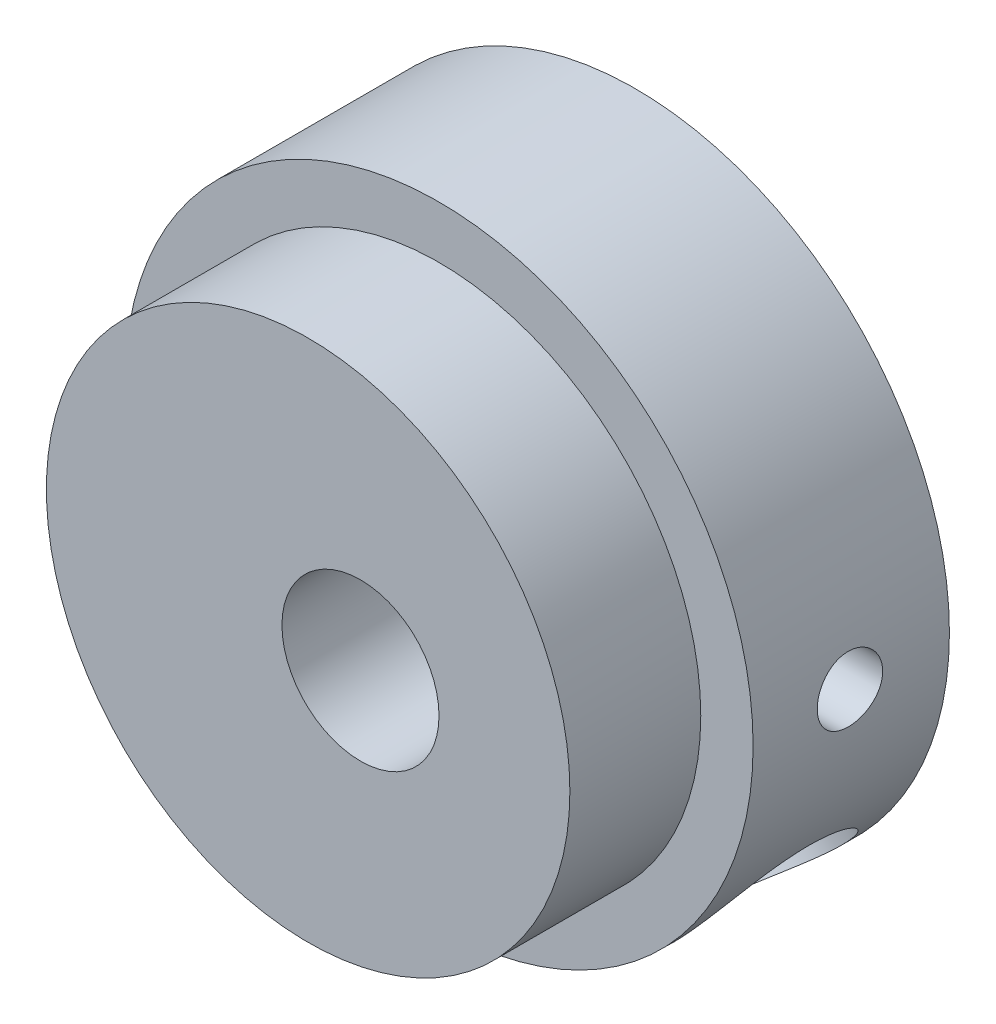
from build123d import *

# Parameters (mm, degrees)
SKETCH1_R                                          = 30.48
BOSS_EXTRUDE1_DEPTH                                = 19.05
SKETCH2_R                                          = 25.4
BOSS_EXTRUDE2_DEPTH                                = 12.7
SKETCH3_R                                          = 7.62
CUT_EXTRUDE1_DEPTH                                 = 47.752
SKETCH4_R                                          = 3.175
CUT_EXTRUDE2_DEPTH                                 = 47.752
CBORE_FOR_5_16_PAN_HEAD_MACHINE_SCREW2_D           = 8.4328
CBORE_FOR_5_16_PAN_HEAD_MACHINE_SCREW2_DEPTH       = 16.002
CBORE_FOR_5_16_PAN_HEAD_MACHINE_SCREW2_CBORE_D     = 16.27124
CBORE_FOR_5_16_PAN_HEAD_MACHINE_SCREW2_CBORE_DEPTH = 5.5372
CBORE_FOR_5_16_PAN_HEAD_MACHINE_SCREW2_TIP         = 2.533468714


with BuildPart() as part:
    # Sketch1 → Boss-Extrude1 (new body)
    with BuildSketch(Plane.XY):
        with Locations(Location((0, 0, 0), (0, 0, 180))):
            Circle(SKETCH1_R)
    extrude(amount=BOSS_EXTRUDE1_DEPTH)

    # Sketch2 → Boss-Extrude2 (add)
    with BuildSketch(Plane.XY.offset(19.05)):
        Circle(SKETCH2_R)
    extrude(amount=BOSS_EXTRUDE2_DEPTH)

    # Sketch3 → Cut-Extrude1 (cut)
    with BuildSketch(Plane(origin=(0, 0, 0), x_dir=(-1, 0, 0), z_dir=(0, 0, -1))):
        with Locations((-5.08, 0)):
            Circle(SKETCH3_R)
    extrude(amount=-CUT_EXTRUDE1_DEPTH, mode=Mode.SUBTRACT)

    # Sketch4 → Cut-Extrude2 (cut)
    with BuildSketch(Plane(origin=(0, 0, 0), x_dir=(0, 0, -1), z_dir=(1, 0, 0))):
        with Locations(Location((-9.652, 0, 0), (0, 0, 180))):
            Circle(SKETCH4_R)
    extrude(amount=CUT_EXTRUDE2_DEPTH, mode=Mode.SUBTRACT)

    # CBORE for 5_16 Pan Head Machine Screw2
    with Locations(Plane(origin=(21.552614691, -21.552614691, 9.652), x_dir=(-0.7071067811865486, -0.7071067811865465, 0), z_dir=(0.7071067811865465, -0.7071067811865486, 0))):
        with Locations((0, 0)):
            CounterBoreHole(CBORE_FOR_5_16_PAN_HEAD_MACHINE_SCREW2_D / 2, CBORE_FOR_5_16_PAN_HEAD_MACHINE_SCREW2_CBORE_D / 2, CBORE_FOR_5_16_PAN_HEAD_MACHINE_SCREW2_CBORE_DEPTH, depth=CBORE_FOR_5_16_PAN_HEAD_MACHINE_SCREW2_DEPTH)
            with Locations((0, 0, -(CBORE_FOR_5_16_PAN_HEAD_MACHINE_SCREW2_DEPTH + CBORE_FOR_5_16_PAN_HEAD_MACHINE_SCREW2_TIP / 2))):  # 118° drill point
                Cone(0, CBORE_FOR_5_16_PAN_HEAD_MACHINE_SCREW2_D / 2, CBORE_FOR_5_16_PAN_HEAD_MACHINE_SCREW2_TIP, mode=Mode.SUBTRACT)


solid = part.part
